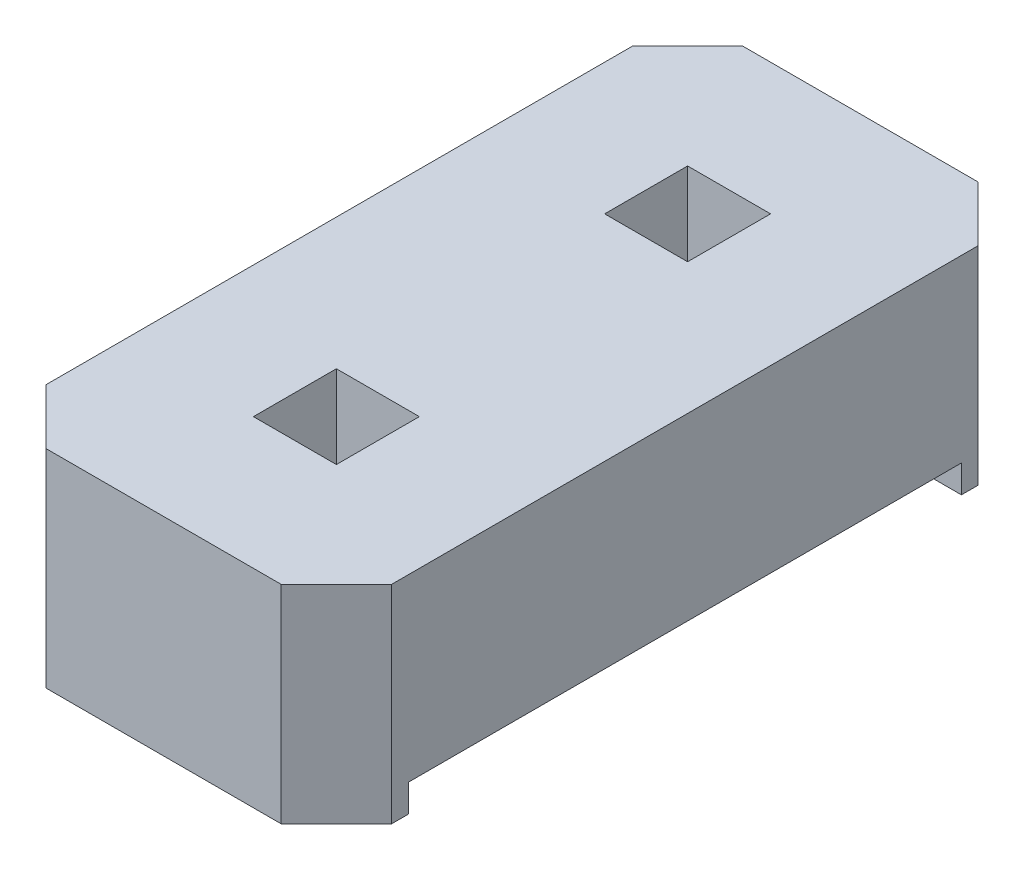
from build123d import *

# Parameters (mm, degrees)
ESQUISSE1_W             = 0.6
ESQUISSE1_H             = 0.6
BOSS_EXTRU_1_DEPTH      = 1.5
ESQUISSE2_W             = 4
ESQUISSE2_H             = 0.4
ENL_V_MAT_EXTRU_1_DEPTH = 4.853621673


with BuildPart() as part:
    # Esquisse1 → Boss.-Extru.1 (new body)
    with BuildSketch(Plane(origin=(0, 0, 0), x_dir=(1, 0, 0), z_dir=(0, 1, 0))):
        Polygon((-1.25, 2.12), (-0.85, 2.52), (0.85, 2.52), (1.25, 2.12), (1.25, -2.12), (0.85, -2.52), (-0.85, -2.52), (-1.25, -2.12), align=None)
        with Locations((0, -1.27)):
            Rectangle(ESQUISSE1_W, ESQUISSE1_H, mode=Mode.SUBTRACT)
        with Locations((0, 1.27)):
            Rectangle(ESQUISSE1_W, ESQUISSE1_H, mode=Mode.SUBTRACT)
    extrude(amount=BOSS_EXTRU_1_DEPTH)

    # Esquisse2 → Enl_v. mat.-Extru.1 (cut, through all)
    with BuildSketch(Plane.ZY.offset(1.25)):
        Rectangle(ESQUISSE2_W, ESQUISSE2_H)
    extrude(amount=-ENL_V_MAT_EXTRU_1_DEPTH, mode=Mode.SUBTRACT)


solid = part.part
